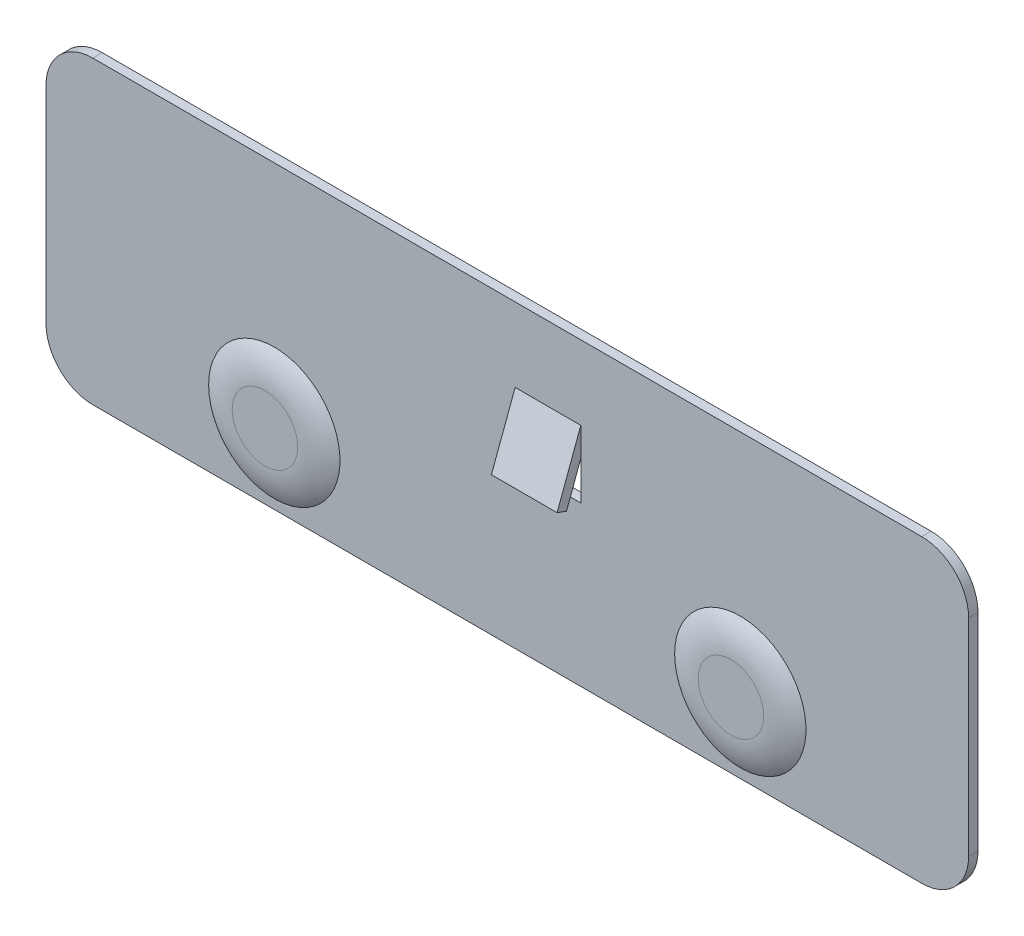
ISO-10303-21;
HEADER;
FILE_DESCRIPTION(('STEP AP214'),'2;1');
FILE_NAME('part.step','',(''),(''),'','','');
FILE_SCHEMA(('AUTOMOTIVE_DESIGN { 1 0 10303 214 1 1 1 1 }'));
ENDSEC;
DATA;
#1=APPLICATION_CONTEXT('core data for automotive mechanical design processes');
#2=APPLICATION_PROTOCOL_DEFINITION('international standard','automotive_design',2000,#1);
#3=PRODUCT_CONTEXT('',#1,'mechanical');
#4=PRODUCT('Part','Part','',(#3));
#5=PRODUCT_RELATED_PRODUCT_CATEGORY('part','',(#4));
#6=PRODUCT_DEFINITION_FORMATION('','',#4);
#7=PRODUCT_DEFINITION_CONTEXT('part definition',#1,'design');
#8=PRODUCT_DEFINITION('design','',#6,#7);
#9=PRODUCT_DEFINITION_SHAPE('','',#8);
#10=(LENGTH_UNIT() NAMED_UNIT(*) SI_UNIT(.MILLI.,.METRE.));
#11=(NAMED_UNIT(*) PLANE_ANGLE_UNIT() SI_UNIT($,.RADIAN.));
#12=(NAMED_UNIT(*) SI_UNIT($,.STERADIAN.) SOLID_ANGLE_UNIT());
#13=UNCERTAINTY_MEASURE_WITH_UNIT(LENGTH_MEASURE(1.E-05),#10,'distance_accuracy_value','');
#14=(GEOMETRIC_REPRESENTATION_CONTEXT(3) GLOBAL_UNCERTAINTY_ASSIGNED_CONTEXT((#13)) GLOBAL_UNIT_ASSIGNED_CONTEXT((#10,
#11,#12)) REPRESENTATION_CONTEXT('',''));
#15=CARTESIAN_POINT('',(0.,0.,0.));
#16=DIRECTION('',(0.,0.,1.));
#17=DIRECTION('',(1.,0.,0.));
#18=AXIS2_PLACEMENT_3D('',#15,#16,#17);
#19=CARTESIAN_POINT('',(1.5,8.1,0.));
#20=DIRECTION('',(0.,0.,-1.));
#21=DIRECTION('',(-1.,0.,0.));
#22=AXIS2_PLACEMENT_3D('',#19,#20,#21);
#23=PLANE('',#22);
#24=CARTESIAN_POINT('',(22.2,2.4,0.));
#25=DIRECTION('',(0.,0.,-1.));
#26=DIRECTION('',(-1.,0.,0.));
#27=AXIS2_PLACEMENT_3D('',#24,#25,#26);
#28=CIRCLE('',#27,1.70825756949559);
#29=CARTESIAN_POINT('',(20.4917424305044,2.4,0.));
#30=VERTEX_POINT('',#29);
#31=EDGE_CURVE('E251',#30,#30,#28,.F.);
#32=ORIENTED_EDGE('',*,*,#31,.T.);
#33=EDGE_LOOP('',(#32));
#34=FACE_BOUND('',#33,.T.);
#35=CARTESIAN_POINT('',(7.3,2.4,0.));
#36=DIRECTION('',(0.,0.,-1.));
#37=DIRECTION('',(-1.,0.,0.));
#38=AXIS2_PLACEMENT_3D('',#35,#36,#37);
#39=CIRCLE('',#38,1.70825756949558);
#40=CARTESIAN_POINT('',(5.59174243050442,2.4,0.));
#41=VERTEX_POINT('',#40);
#42=EDGE_CURVE('E248',#41,#41,#39,.F.);
#43=ORIENTED_EDGE('',*,*,#42,.T.);
#44=EDGE_LOOP('',(#43));
#45=FACE_BOUND('',#44,.T.);
#46=CARTESIAN_POINT('',(1.5,8.1,0.));
#47=DIRECTION('',(0.,0.,1.));
#48=DIRECTION('',(-1.,0.,0.));
#49=AXIS2_PLACEMENT_3D('',#46,#47,#48);
#50=CIRCLE('',#49,1.5);
#51=CARTESIAN_POINT('',(1.5,9.6,0.));
#52=VERTEX_POINT('',#51);
#53=CARTESIAN_POINT('',(0.,8.1,0.));
#54=VERTEX_POINT('',#53);
#55=EDGE_CURVE('E178',#52,#54,#50,.T.);
#56=ORIENTED_EDGE('',*,*,#55,.F.);
#57=DIRECTION('',(-1.,0.,0.));
#58=VECTOR('',#57,1.);
#59=CARTESIAN_POINT('',(1.5,9.6,0.));
#60=LINE('',#59,#58);
#61=CARTESIAN_POINT('',(28.,9.6,0.));
#62=VERTEX_POINT('',#61);
#63=EDGE_CURVE('E201',#62,#52,#60,.T.);
#64=ORIENTED_EDGE('',*,*,#63,.F.);
#65=CARTESIAN_POINT('',(28.,8.1,0.));
#66=DIRECTION('',(0.,0.,1.));
#67=DIRECTION('',(-1.,0.,0.));
#68=AXIS2_PLACEMENT_3D('',#65,#66,#67);
#69=CIRCLE('',#68,1.5);
#70=CARTESIAN_POINT('',(29.5,8.1,0.));
#71=VERTEX_POINT('',#70);
#72=EDGE_CURVE('E199',#71,#62,#69,.T.);
#73=ORIENTED_EDGE('',*,*,#72,.F.);
#74=DIRECTION('',(0.,1.,0.));
#75=VECTOR('',#74,1.);
#76=CARTESIAN_POINT('',(29.5,1.5,0.));
#77=LINE('',#76,#75);
#78=CARTESIAN_POINT('',(29.5,1.5,0.));
#79=VERTEX_POINT('',#78);
#80=EDGE_CURVE('E197',#79,#71,#77,.T.);
#81=ORIENTED_EDGE('',*,*,#80,.F.);
#82=CARTESIAN_POINT('',(28.,1.5,0.));
#83=DIRECTION('',(0.,0.,1.));
#84=DIRECTION('',(1.,0.,0.));
#85=AXIS2_PLACEMENT_3D('',#82,#83,#84);
#86=CIRCLE('',#85,1.5);
#87=CARTESIAN_POINT('',(28.,0.,0.));
#88=VERTEX_POINT('',#87);
#89=EDGE_CURVE('E195',#88,#79,#86,.T.);
#90=ORIENTED_EDGE('',*,*,#89,.F.);
#91=DIRECTION('',(1.,0.,0.));
#92=VECTOR('',#91,1.);
#93=CARTESIAN_POINT('',(1.50000000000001,0.,0.));
#94=LINE('',#93,#92);
#95=CARTESIAN_POINT('',(1.50000000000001,0.,0.));
#96=VERTEX_POINT('',#95);
#97=EDGE_CURVE('E193',#96,#88,#94,.T.);
#98=ORIENTED_EDGE('',*,*,#97,.F.);
#99=CARTESIAN_POINT('',(1.5,1.5,0.));
#100=DIRECTION('',(0.,0.,1.));
#101=DIRECTION('',(-1.,0.,0.));
#102=AXIS2_PLACEMENT_3D('',#99,#100,#101);
#103=CIRCLE('',#102,1.5);
#104=CARTESIAN_POINT('',(0.,1.50000000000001,0.));
#105=VERTEX_POINT('',#104);
#106=EDGE_CURVE('E191',#105,#96,#103,.T.);
#107=ORIENTED_EDGE('',*,*,#106,.F.);
#108=DIRECTION('',(0.,-1.,0.));
#109=VECTOR('',#108,1.);
#110=CARTESIAN_POINT('',(0.,1.50000000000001,0.));
#111=LINE('',#110,#109);
#112=EDGE_CURVE('E189',#54,#105,#111,.T.);
#113=ORIENTED_EDGE('',*,*,#112,.F.);
#114=EDGE_LOOP('',(#56,#64,#73,#81,#90,#98,#107,#113));
#115=FACE_BOUND('',#114,.T.);
#116=DIRECTION('',(-1.,0.,0.));
#117=VECTOR('',#116,1.);
#118=CARTESIAN_POINT('',(17.1,5.081395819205,0.));
#119=LINE('',#118,#117);
#120=CARTESIAN_POINT('',(17.1,5.081395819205,0.));
#121=VERTEX_POINT('',#120);
#122=CARTESIAN_POINT('',(15.,5.081395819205,0.));
#123=VERTEX_POINT('',#122);
#124=EDGE_CURVE('E284',#121,#123,#119,.T.);
#125=ORIENTED_EDGE('',*,*,#124,.F.);
#126=DIRECTION('',(0.,-1.,0.));
#127=VECTOR('',#126,1.);
#128=CARTESIAN_POINT('',(17.1,7.11976791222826,0.));
#129=LINE('',#128,#127);
#130=CARTESIAN_POINT('',(17.1,7.11976791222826,0.));
#131=VERTEX_POINT('',#130);
#132=EDGE_CURVE('E270',#131,#121,#129,.T.);
#133=ORIENTED_EDGE('',*,*,#132,.F.);
#134=DIRECTION('',(-1.,0.,0.));
#135=VECTOR('',#134,1.);
#136=CARTESIAN_POINT('',(17.1,7.11976791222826,0.));
#137=LINE('',#136,#135);
#138=CARTESIAN_POINT('',(15.,7.11976791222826,0.));
#139=VERTEX_POINT('',#138);
#140=EDGE_CURVE('E271',#131,#139,#137,.T.);
#141=ORIENTED_EDGE('',*,*,#140,.T.);
#142=DIRECTION('',(0.,-1.,0.));
#143=VECTOR('',#142,1.);
#144=CARTESIAN_POINT('',(15.,7.11976791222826,0.));
#145=LINE('',#144,#143);
#146=EDGE_CURVE('E288',#139,#123,#145,.T.);
#147=ORIENTED_EDGE('',*,*,#146,.T.);
#148=EDGE_LOOP('',(#125,#133,#141,#147));
#149=FACE_BOUND('',#148,.T.);
#150=ADVANCED_FACE('F31',(#34,#45,#115,#149),#23,.T.);
#151=CARTESIAN_POINT('',(1.5,8.1,0.3));
#152=DIRECTION('',(0.,0.,-1.));
#153=DIRECTION('',(-1.,0.,0.));
#154=AXIS2_PLACEMENT_3D('',#151,#152,#153);
#155=PLANE('',#154);
#156=CARTESIAN_POINT('',(22.2,2.4,0.3));
#157=DIRECTION('',(0.,0.,-1.));
#158=DIRECTION('',(-1.,0.,0.));
#159=AXIS2_PLACEMENT_3D('',#156,#157,#158);
#160=CIRCLE('',#159,2.1);
#161=CARTESIAN_POINT('',(20.1,2.4,0.3));
#162=VERTEX_POINT('',#161);
#163=EDGE_CURVE('E179',#162,#162,#160,.F.);
#164=ORIENTED_EDGE('',*,*,#163,.F.);
#165=EDGE_LOOP('',(#164));
#166=FACE_BOUND('',#165,.T.);
#167=CARTESIAN_POINT('',(1.5,8.1,0.3));
#168=DIRECTION('',(0.,0.,1.));
#169=DIRECTION('',(-1.,0.,0.));
#170=AXIS2_PLACEMENT_3D('',#167,#168,#169);
#171=CIRCLE('',#170,1.5);
#172=CARTESIAN_POINT('',(1.5,9.6,0.3));
#173=VERTEX_POINT('',#172);
#174=CARTESIAN_POINT('',(0.,8.1,0.3));
#175=VERTEX_POINT('',#174);
#176=EDGE_CURVE('E203',#173,#175,#171,.T.);
#177=ORIENTED_EDGE('',*,*,#176,.T.);
#178=DIRECTION('',(0.,-1.,0.));
#179=VECTOR('',#178,1.);
#180=CARTESIAN_POINT('',(0.,1.50000000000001,0.3));
#181=LINE('',#180,#179);
#182=CARTESIAN_POINT('',(0.,1.50000000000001,0.3));
#183=VERTEX_POINT('',#182);
#184=EDGE_CURVE('E206',#175,#183,#181,.T.);
#185=ORIENTED_EDGE('',*,*,#184,.T.);
#186=CARTESIAN_POINT('',(1.5,1.5,0.3));
#187=DIRECTION('',(0.,0.,1.));
#188=DIRECTION('',(-1.,0.,0.));
#189=AXIS2_PLACEMENT_3D('',#186,#187,#188);
#190=CIRCLE('',#189,1.5);
#191=CARTESIAN_POINT('',(1.50000000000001,0.,0.3));
#192=VERTEX_POINT('',#191);
#193=EDGE_CURVE('E208',#183,#192,#190,.T.);
#194=ORIENTED_EDGE('',*,*,#193,.T.);
#195=DIRECTION('',(1.,0.,0.));
#196=VECTOR('',#195,1.);
#197=CARTESIAN_POINT('',(1.50000000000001,0.,0.3));
#198=LINE('',#197,#196);
#199=CARTESIAN_POINT('',(28.,0.,0.3));
#200=VERTEX_POINT('',#199);
#201=EDGE_CURVE('E210',#192,#200,#198,.T.);
#202=ORIENTED_EDGE('',*,*,#201,.T.);
#203=CARTESIAN_POINT('',(28.,1.5,0.3));
#204=DIRECTION('',(0.,0.,1.));
#205=DIRECTION('',(1.,0.,0.));
#206=AXIS2_PLACEMENT_3D('',#203,#204,#205);
#207=CIRCLE('',#206,1.5);
#208=CARTESIAN_POINT('',(29.5,1.5,0.3));
#209=VERTEX_POINT('',#208);
#210=EDGE_CURVE('E212',#200,#209,#207,.T.);
#211=ORIENTED_EDGE('',*,*,#210,.T.);
#212=DIRECTION('',(0.,1.,0.));
#213=VECTOR('',#212,1.);
#214=CARTESIAN_POINT('',(29.5,1.5,0.3));
#215=LINE('',#214,#213);
#216=CARTESIAN_POINT('',(29.5,8.1,0.3));
#217=VERTEX_POINT('',#216);
#218=EDGE_CURVE('E214',#209,#217,#215,.T.);
#219=ORIENTED_EDGE('',*,*,#218,.T.);
#220=CARTESIAN_POINT('',(28.,8.1,0.3));
#221=DIRECTION('',(0.,0.,1.));
#222=DIRECTION('',(-1.,0.,0.));
#223=AXIS2_PLACEMENT_3D('',#220,#221,#222);
#224=CIRCLE('',#223,1.5);
#225=CARTESIAN_POINT('',(28.,9.6,0.3));
#226=VERTEX_POINT('',#225);
#227=EDGE_CURVE('E216',#217,#226,#224,.T.);
#228=ORIENTED_EDGE('',*,*,#227,.T.);
#229=DIRECTION('',(-1.,0.,0.));
#230=VECTOR('',#229,1.);
#231=CARTESIAN_POINT('',(1.5,9.6,0.3));
#232=LINE('',#231,#230);
#233=EDGE_CURVE('E218',#226,#173,#232,.T.);
#234=ORIENTED_EDGE('',*,*,#233,.T.);
#235=EDGE_LOOP('',(#177,#185,#194,#202,#211,#219,#228,#234));
#236=FACE_BOUND('',#235,.T.);
#237=CARTESIAN_POINT('',(7.3,2.4,0.3));
#238=DIRECTION('',(0.,0.,-1.));
#239=DIRECTION('',(-1.,0.,0.));
#240=AXIS2_PLACEMENT_3D('',#237,#238,#239);
#241=CIRCLE('',#240,2.1);
#242=CARTESIAN_POINT('',(5.2,2.4,0.3));
#243=VERTEX_POINT('',#242);
#244=EDGE_CURVE('E183',#243,#243,#241,.F.);
#245=ORIENTED_EDGE('',*,*,#244,.F.);
#246=EDGE_LOOP('',(#245));
#247=FACE_BOUND('',#246,.T.);
#248=DIRECTION('',(0.,-1.,0.));
#249=VECTOR('',#248,1.);
#250=CARTESIAN_POINT('',(15.,8.1,0.3));
#251=LINE('',#250,#249);
#252=CARTESIAN_POINT('',(15.,7.231395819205,0.3));
#253=VERTEX_POINT('',#252);
#254=CARTESIAN_POINT('',(15.,6.31351791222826,0.3));
#255=VERTEX_POINT('',#254);
#256=EDGE_CURVE('E11',#253,#255,#251,.T.);
#257=ORIENTED_EDGE('',*,*,#256,.F.);
#258=DIRECTION('',(-1.,0.,0.));
#259=VECTOR('',#258,1.);
#260=CARTESIAN_POINT('',(1.5,7.231395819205,0.3));
#261=LINE('',#260,#259);
#262=CARTESIAN_POINT('',(17.1,7.231395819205,0.3));
#263=VERTEX_POINT('',#262);
#264=EDGE_CURVE('E162',#263,#253,#261,.T.);
#265=ORIENTED_EDGE('',*,*,#264,.F.);
#266=DIRECTION('',(0.,1.,0.));
#267=VECTOR('',#266,1.);
#268=CARTESIAN_POINT('',(17.1,8.1,0.3));
#269=LINE('',#268,#267);
#270=CARTESIAN_POINT('',(17.1,6.31351791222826,0.3));
#271=VERTEX_POINT('',#270);
#272=EDGE_CURVE('E255',#271,#263,#269,.T.);
#273=ORIENTED_EDGE('',*,*,#272,.F.);
#274=CARTESIAN_POINT('',(17.1,5.081395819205,0.3));
#275=VERTEX_POINT('',#274);
#276=EDGE_CURVE('E256',#275,#271,#269,.T.);
#277=ORIENTED_EDGE('',*,*,#276,.F.);
#278=DIRECTION('',(1.,0.,0.));
#279=VECTOR('',#278,1.);
#280=CARTESIAN_POINT('',(1.5,5.081395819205,0.3));
#281=LINE('',#280,#279);
#282=CARTESIAN_POINT('',(15.,5.081395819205,0.3));
#283=VERTEX_POINT('',#282);
#284=EDGE_CURVE('E39',#283,#275,#281,.T.);
#285=ORIENTED_EDGE('',*,*,#284,.F.);
#286=DIRECTION('',(0.,1.,0.));
#287=VECTOR('',#286,1.);
#288=CARTESIAN_POINT('',(15.,8.1,0.3));
#289=LINE('',#288,#287);
#290=EDGE_CURVE('E164',#283,#255,#289,.T.);
#291=ORIENTED_EDGE('',*,*,#290,.T.);
#292=EDGE_LOOP('',(#257,#265,#273,#277,#285,#291));
#293=FACE_BOUND('',#292,.T.);
#294=ADVANCED_FACE('F274',(#166,#236,#247,#293),#155,.F.);
#295=CARTESIAN_POINT('',(1.5,8.1,0.3));
#296=DIRECTION('',(0.,0.,-1.));
#297=DIRECTION('',(-1.,0.,0.));
#298=AXIS2_PLACEMENT_3D('',#295,#296,#297);
#299=CYLINDRICAL_SURFACE('',#298,1.5);
#300=ORIENTED_EDGE('',*,*,#55,.T.);
#301=DIRECTION('',(0.,0.,-1.));
#302=VECTOR('',#301,1.);
#303=CARTESIAN_POINT('',(0.,8.1,0.3));
#304=LINE('',#303,#302);
#305=EDGE_CURVE('E186',#175,#54,#304,.T.);
#306=ORIENTED_EDGE('',*,*,#305,.F.);
#307=ORIENTED_EDGE('',*,*,#176,.F.);
#308=DIRECTION('',(0.,0.,-1.));
#309=VECTOR('',#308,1.);
#310=CARTESIAN_POINT('',(1.5,9.6,0.3));
#311=LINE('',#310,#309);
#312=EDGE_CURVE('E220',#173,#52,#311,.T.);
#313=ORIENTED_EDGE('',*,*,#312,.T.);
#314=EDGE_LOOP('',(#300,#306,#307,#313));
#315=FACE_BOUND('',#314,.T.);
#316=ADVANCED_FACE('F33',(#315),#299,.T.);
#317=CARTESIAN_POINT('',(0.,1.50000000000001,0.3));
#318=DIRECTION('',(1.,0.,0.));
#319=DIRECTION('',(0.,0.,-1.));
#320=AXIS2_PLACEMENT_3D('',#317,#318,#319);
#321=PLANE('',#320);
#322=ORIENTED_EDGE('',*,*,#112,.T.);
#323=DIRECTION('',(0.,0.,-1.));
#324=VECTOR('',#323,1.);
#325=CARTESIAN_POINT('',(0.,1.50000000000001,0.3));
#326=LINE('',#325,#324);
#327=EDGE_CURVE('E238',#183,#105,#326,.T.);
#328=ORIENTED_EDGE('',*,*,#327,.F.);
#329=ORIENTED_EDGE('',*,*,#184,.F.);
#330=ORIENTED_EDGE('',*,*,#305,.T.);
#331=EDGE_LOOP('',(#322,#328,#329,#330));
#332=FACE_BOUND('',#331,.T.);
#333=ADVANCED_FACE('F338',(#332),#321,.F.);
#334=CARTESIAN_POINT('',(1.5,1.5,0.3));
#335=DIRECTION('',(0.,0.,-1.));
#336=DIRECTION('',(-1.,0.,0.));
#337=AXIS2_PLACEMENT_3D('',#334,#335,#336);
#338=CYLINDRICAL_SURFACE('',#337,1.5);
#339=ORIENTED_EDGE('',*,*,#106,.T.);
#340=DIRECTION('',(0.,0.,-1.));
#341=VECTOR('',#340,1.);
#342=CARTESIAN_POINT('',(1.50000000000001,0.,0.3));
#343=LINE('',#342,#341);
#344=EDGE_CURVE('E235',#192,#96,#343,.T.);
#345=ORIENTED_EDGE('',*,*,#344,.F.);
#346=ORIENTED_EDGE('',*,*,#193,.F.);
#347=ORIENTED_EDGE('',*,*,#327,.T.);
#348=EDGE_LOOP('',(#339,#345,#346,#347));
#349=FACE_BOUND('',#348,.T.);
#350=ADVANCED_FACE('F335',(#349),#338,.T.);
#351=CARTESIAN_POINT('',(1.50000000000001,0.,0.3));
#352=DIRECTION('',(0.,1.,0.));
#353=DIRECTION('',(0.,0.,1.));
#354=AXIS2_PLACEMENT_3D('',#351,#352,#353);
#355=PLANE('',#354);
#356=ORIENTED_EDGE('',*,*,#97,.T.);
#357=DIRECTION('',(0.,0.,-1.));
#358=VECTOR('',#357,1.);
#359=CARTESIAN_POINT('',(28.,0.,0.3));
#360=LINE('',#359,#358);
#361=EDGE_CURVE('E232',#200,#88,#360,.T.);
#362=ORIENTED_EDGE('',*,*,#361,.F.);
#363=ORIENTED_EDGE('',*,*,#201,.F.);
#364=ORIENTED_EDGE('',*,*,#344,.T.);
#365=EDGE_LOOP('',(#356,#362,#363,#364));
#366=FACE_BOUND('',#365,.T.);
#367=ADVANCED_FACE('F331',(#366),#355,.F.);
#368=CARTESIAN_POINT('',(28.,1.5,0.3));
#369=DIRECTION('',(0.,0.,-1.));
#370=DIRECTION('',(-1.,0.,0.));
#371=AXIS2_PLACEMENT_3D('',#368,#369,#370);
#372=CYLINDRICAL_SURFACE('',#371,1.5);
#373=ORIENTED_EDGE('',*,*,#89,.T.);
#374=DIRECTION('',(0.,0.,-1.));
#375=VECTOR('',#374,1.);
#376=CARTESIAN_POINT('',(29.5,1.5,0.3));
#377=LINE('',#376,#375);
#378=EDGE_CURVE('E229',#209,#79,#377,.T.);
#379=ORIENTED_EDGE('',*,*,#378,.F.);
#380=ORIENTED_EDGE('',*,*,#210,.F.);
#381=ORIENTED_EDGE('',*,*,#361,.T.);
#382=EDGE_LOOP('',(#373,#379,#380,#381));
#383=FACE_BOUND('',#382,.T.);
#384=ADVANCED_FACE('F327',(#383),#372,.T.);
#385=CARTESIAN_POINT('',(29.5,1.5,0.3));
#386=DIRECTION('',(-1.,0.,0.));
#387=DIRECTION('',(0.,0.,1.));
#388=AXIS2_PLACEMENT_3D('',#385,#386,#387);
#389=PLANE('',#388);
#390=ORIENTED_EDGE('',*,*,#80,.T.);
#391=DIRECTION('',(0.,0.,-1.));
#392=VECTOR('',#391,1.);
#393=CARTESIAN_POINT('',(29.5,8.1,0.3));
#394=LINE('',#393,#392);
#395=EDGE_CURVE('E226',#217,#71,#394,.T.);
#396=ORIENTED_EDGE('',*,*,#395,.F.);
#397=ORIENTED_EDGE('',*,*,#218,.F.);
#398=ORIENTED_EDGE('',*,*,#378,.T.);
#399=EDGE_LOOP('',(#390,#396,#397,#398));
#400=FACE_BOUND('',#399,.T.);
#401=ADVANCED_FACE('F323',(#400),#389,.F.);
#402=CARTESIAN_POINT('',(28.,8.1,0.3));
#403=DIRECTION('',(0.,0.,-1.));
#404=DIRECTION('',(-1.,0.,0.));
#405=AXIS2_PLACEMENT_3D('',#402,#403,#404);
#406=CYLINDRICAL_SURFACE('',#405,1.5);
#407=ORIENTED_EDGE('',*,*,#72,.T.);
#408=DIRECTION('',(0.,0.,-1.));
#409=VECTOR('',#408,1.);
#410=CARTESIAN_POINT('',(28.,9.6,0.3));
#411=LINE('',#410,#409);
#412=EDGE_CURVE('E223',#226,#62,#411,.T.);
#413=ORIENTED_EDGE('',*,*,#412,.F.);
#414=ORIENTED_EDGE('',*,*,#227,.F.);
#415=ORIENTED_EDGE('',*,*,#395,.T.);
#416=EDGE_LOOP('',(#407,#413,#414,#415));
#417=FACE_BOUND('',#416,.T.);
#418=ADVANCED_FACE('F319',(#417),#406,.T.);
#419=CARTESIAN_POINT('',(1.5,9.6,0.3));
#420=DIRECTION('',(0.,-1.,0.));
#421=DIRECTION('',(0.,0.,-1.));
#422=AXIS2_PLACEMENT_3D('',#419,#420,#421);
#423=PLANE('',#422);
#424=ORIENTED_EDGE('',*,*,#63,.T.);
#425=ORIENTED_EDGE('',*,*,#312,.F.);
#426=ORIENTED_EDGE('',*,*,#233,.F.);
#427=ORIENTED_EDGE('',*,*,#412,.T.);
#428=EDGE_LOOP('',(#424,#425,#426,#427));
#429=FACE_BOUND('',#428,.T.);
#430=ADVANCED_FACE('F316',(#429),#423,.F.);
#431=CARTESIAN_POINT('',(7.3,2.4,0.6));
#432=DIRECTION('',(0.,0.,1.));
#433=DIRECTION('',(1.,0.,0.));
#434=AXIS2_PLACEMENT_3D('',#431,#432,#433);
#435=PLANE('',#434);
#436=CARTESIAN_POINT('',(7.3,2.4,0.6));
#437=DIRECTION('',(0.,0.,1.));
#438=DIRECTION('',(1.,0.,0.));
#439=AXIS2_PLACEMENT_3D('',#436,#437,#438);
#440=CIRCLE('',#439,1.04643462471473);
#441=CARTESIAN_POINT('',(8.34643462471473,2.4,0.6));
#442=VERTEX_POINT('',#441);
#443=EDGE_CURVE('E245',#442,#442,#440,.T.);
#444=ORIENTED_EDGE('',*,*,#443,.T.);
#445=EDGE_LOOP('',(#444));
#446=FACE_BOUND('',#445,.T.);
#447=ADVANCED_FACE('F313',(#446),#435,.T.);
#448=CARTESIAN_POINT('',(22.2,2.4,0.6));
#449=DIRECTION('',(0.,0.,1.));
#450=DIRECTION('',(1.,0.,0.));
#451=AXIS2_PLACEMENT_3D('',#448,#449,#450);
#452=PLANE('',#451);
#453=CARTESIAN_POINT('',(22.2,2.4,0.6));
#454=DIRECTION('',(0.,0.,1.));
#455=DIRECTION('',(1.,0.,0.));
#456=AXIS2_PLACEMENT_3D('',#453,#454,#455);
#457=CIRCLE('',#456,1.04643462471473);
#458=CARTESIAN_POINT('',(23.2464346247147,2.4,0.6));
#459=VERTEX_POINT('',#458);
#460=EDGE_CURVE('E182',#459,#459,#457,.T.);
#461=ORIENTED_EDGE('',*,*,#460,.T.);
#462=EDGE_LOOP('',(#461));
#463=FACE_BOUND('',#462,.T.);
#464=ADVANCED_FACE('F382',(#463),#452,.T.);
#465=CARTESIAN_POINT('',(22.2,2.4,-1.4));
#466=DIRECTION('',(0.,0.,-1.));
#467=DIRECTION('',(-1.,0.,0.));
#468=AXIS2_PLACEMENT_3D('',#465,#466,#467);
#469=DEGENERATE_TOROIDAL_SURFACE('',#468,1.04643462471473,2.,.T.);
#470=ORIENTED_EDGE('',*,*,#163,.T.);
#471=EDGE_LOOP('',(#470));
#472=FACE_BOUND('',#471,.T.);
#473=ORIENTED_EDGE('',*,*,#460,.F.);
#474=EDGE_LOOP('',(#473));
#475=FACE_BOUND('',#474,.T.);
#476=ADVANCED_FACE('F377',(#472,#475),#469,.T.);
#477=CARTESIAN_POINT('',(7.3,2.4,-1.4));
#478=DIRECTION('',(0.,0.,-1.));
#479=DIRECTION('',(-1.,0.,0.));
#480=AXIS2_PLACEMENT_3D('',#477,#478,#479);
#481=DEGENERATE_TOROIDAL_SURFACE('',#480,1.04643462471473,2.,.T.);
#482=ORIENTED_EDGE('',*,*,#244,.T.);
#483=EDGE_LOOP('',(#482));
#484=FACE_BOUND('',#483,.T.);
#485=ORIENTED_EDGE('',*,*,#443,.F.);
#486=EDGE_LOOP('',(#485));
#487=FACE_BOUND('',#486,.T.);
#488=ADVANCED_FACE('F373',(#484,#487),#481,.T.);
#489=CARTESIAN_POINT('',(7.3,2.4,0.3));
#490=DIRECTION('',(0.,0.,1.));
#491=DIRECTION('',(1.,0.,0.));
#492=AXIS2_PLACEMENT_3D('',#489,#490,#491);
#493=PLANE('',#492);
#494=CARTESIAN_POINT('',(7.3,2.4,0.3));
#495=DIRECTION('',(0.,0.,1.));
#496=DIRECTION('',(1.,0.,0.));
#497=AXIS2_PLACEMENT_3D('',#494,#495,#496);
#498=CIRCLE('',#497,1.25);
#499=CARTESIAN_POINT('',(8.55,2.4,0.3));
#500=VERTEX_POINT('',#499);
#501=EDGE_CURVE('E175',#500,#500,#498,.T.);
#502=ORIENTED_EDGE('',*,*,#501,.F.);
#503=EDGE_LOOP('',(#502));
#504=FACE_BOUND('',#503,.T.);
#505=ADVANCED_FACE('F376',(#504),#493,.F.);
#506=CARTESIAN_POINT('',(22.2,2.4,0.3));
#507=DIRECTION('',(0.,0.,1.));
#508=DIRECTION('',(1.,0.,0.));
#509=AXIS2_PLACEMENT_3D('',#506,#507,#508);
#510=PLANE('',#509);
#511=CARTESIAN_POINT('',(22.2,2.4,0.3));
#512=DIRECTION('',(0.,0.,1.));
#513=DIRECTION('',(1.,0.,0.));
#514=AXIS2_PLACEMENT_3D('',#511,#512,#513);
#515=CIRCLE('',#514,1.25);
#516=CARTESIAN_POINT('',(23.45,2.4,0.3));
#517=VERTEX_POINT('',#516);
#518=EDGE_CURVE('E166',#517,#517,#515,.T.);
#519=ORIENTED_EDGE('',*,*,#518,.F.);
#520=EDGE_LOOP('',(#519));
#521=FACE_BOUND('',#520,.T.);
#522=ADVANCED_FACE('F395',(#521),#510,.F.);
#523=CARTESIAN_POINT('',(22.2,2.4,0.5));
#524=DIRECTION('',(0.,0.,-1.));
#525=DIRECTION('',(-1.,0.,0.));
#526=AXIS2_PLACEMENT_3D('',#523,#524,#525);
#527=TOROIDAL_SURFACE('',#526,1.70825756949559,0.5);
#528=ORIENTED_EDGE('',*,*,#518,.T.);
#529=EDGE_LOOP('',(#528));
#530=FACE_BOUND('',#529,.T.);
#531=ORIENTED_EDGE('',*,*,#31,.F.);
#532=EDGE_LOOP('',(#531));
#533=FACE_BOUND('',#532,.T.);
#534=ADVANCED_FACE('F399',(#530,#533),#527,.T.);
#535=CARTESIAN_POINT('',(7.3,2.4,0.5));
#536=DIRECTION('',(0.,0.,-1.));
#537=DIRECTION('',(-1.,0.,0.));
#538=AXIS2_PLACEMENT_3D('',#535,#536,#537);
#539=TOROIDAL_SURFACE('',#538,1.70825756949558,0.5);
#540=ORIENTED_EDGE('',*,*,#501,.T.);
#541=EDGE_LOOP('',(#540));
#542=FACE_BOUND('',#541,.T.);
#543=ORIENTED_EDGE('',*,*,#42,.F.);
#544=EDGE_LOOP('',(#543));
#545=FACE_BOUND('',#544,.T.);
#546=ADVANCED_FACE('F403',(#542,#545),#539,.T.);
#547=CARTESIAN_POINT('',(15.,7.231395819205,1.1));
#548=DIRECTION('',(1.,0.,0.));
#549=DIRECTION('',(0.,0.,-1.));
#550=AXIS2_PLACEMENT_3D('',#547,#548,#549);
#551=PLANE('',#550);
#552=DIRECTION('',(0.,0.937221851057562,-0.348733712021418));
#553=VECTOR('',#552,1.);
#554=CARTESIAN_POINT('',(15.,7.11976791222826,0.));
#555=LINE('',#554,#553);
#556=CARTESIAN_POINT('',(15.,5.081395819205,0.758464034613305));
#557=VERTEX_POINT('',#556);
#558=EDGE_CURVE('E158',#557,#255,#555,.T.);
#559=ORIENTED_EDGE('',*,*,#558,.F.);
#560=DIRECTION('',(0.,-0.348733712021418,-0.937221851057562));
#561=VECTOR('',#560,1.);
#562=CARTESIAN_POINT('',(15.,5.081395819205,0.758464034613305));
#563=LINE('',#562,#561);
#564=CARTESIAN_POINT('',(15.,5.19302372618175,1.0584640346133));
#565=VERTEX_POINT('',#564);
#566=EDGE_CURVE('E142',#565,#557,#563,.T.);
#567=ORIENTED_EDGE('',*,*,#566,.F.);
#568=DIRECTION('',(0.,-0.937221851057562,0.348733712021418));
#569=VECTOR('',#568,1.);
#570=CARTESIAN_POINT('',(15.,7.231395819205,0.3));
#571=LINE('',#570,#569);
#572=EDGE_CURVE('E155',#253,#565,#571,.T.);
#573=ORIENTED_EDGE('',*,*,#572,.F.);
#574=ORIENTED_EDGE('',*,*,#256,.T.);
#575=EDGE_LOOP('',(#559,#567,#573,#574));
#576=FACE_BOUND('',#575,.T.);
#577=ADVANCED_FACE('F154',(#576),#551,.F.);
#578=CARTESIAN_POINT('',(17.1,7.231395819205,1.1));
#579=DIRECTION('',(-1.,0.,0.));
#580=DIRECTION('',(0.,0.,1.));
#581=AXIS2_PLACEMENT_3D('',#578,#579,#580);
#582=PLANE('',#581);
#583=DIRECTION('',(0.,-0.937221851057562,0.348733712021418));
#584=VECTOR('',#583,1.);
#585=CARTESIAN_POINT('',(17.1,7.231395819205,0.3));
#586=LINE('',#585,#584);
#587=CARTESIAN_POINT('',(17.1,5.19302372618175,1.0584640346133));
#588=VERTEX_POINT('',#587);
#589=EDGE_CURVE('E163',#263,#588,#586,.T.);
#590=ORIENTED_EDGE('',*,*,#589,.T.);
#591=DIRECTION('',(0.,-0.348733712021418,-0.937221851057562));
#592=VECTOR('',#591,1.);
#593=CARTESIAN_POINT('',(17.1,5.45449641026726,1.76117187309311));
#594=LINE('',#593,#592);
#595=CARTESIAN_POINT('',(17.1,5.081395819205,0.758464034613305));
#596=VERTEX_POINT('',#595);
#597=EDGE_CURVE('E145',#588,#596,#594,.T.);
#598=ORIENTED_EDGE('',*,*,#597,.T.);
#599=DIRECTION('',(0.,0.937221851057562,-0.348733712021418));
#600=VECTOR('',#599,1.);
#601=CARTESIAN_POINT('',(17.1,7.11976791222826,0.));
#602=LINE('',#601,#600);
#603=EDGE_CURVE('E277',#596,#271,#602,.T.);
#604=ORIENTED_EDGE('',*,*,#603,.T.);
#605=ORIENTED_EDGE('',*,*,#272,.T.);
#606=EDGE_LOOP('',(#590,#598,#604,#605));
#607=FACE_BOUND('',#606,.T.);
#608=ADVANCED_FACE('F276',(#607),#582,.F.);
#609=CARTESIAN_POINT('',(17.1,7.231395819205,0.3));
#610=DIRECTION('',(0.,-0.348733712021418,-0.937221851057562));
#611=DIRECTION('',(0.,0.937221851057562,-0.348733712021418));
#612=AXIS2_PLACEMENT_3D('',#609,#610,#611);
#613=PLANE('',#612);
#614=ORIENTED_EDGE('',*,*,#572,.T.);
#615=DIRECTION('',(-1.,0.,0.));
#616=VECTOR('',#615,1.);
#617=CARTESIAN_POINT('',(29.5,5.19302372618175,1.0584640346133));
#618=LINE('',#617,#616);
#619=EDGE_CURVE('E139',#588,#565,#618,.T.);
#620=ORIENTED_EDGE('',*,*,#619,.F.);
#621=ORIENTED_EDGE('',*,*,#589,.F.);
#622=ORIENTED_EDGE('',*,*,#264,.T.);
#623=EDGE_LOOP('',(#614,#620,#621,#622));
#624=FACE_BOUND('',#623,.T.);
#625=ADVANCED_FACE('F160',(#624),#613,.F.);
#626=CARTESIAN_POINT('',(17.1,5.081395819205,0.758464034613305));
#627=DIRECTION('',(-1.,0.,0.));
#628=DIRECTION('',(0.,0.,1.));
#629=AXIS2_PLACEMENT_3D('',#626,#627,#628);
#630=PLANE('',#629);
#631=ORIENTED_EDGE('',*,*,#276,.T.);
#632=EDGE_CURVE('E54',#271,#131,#602,.T.);
#633=ORIENTED_EDGE('',*,*,#632,.T.);
#634=ORIENTED_EDGE('',*,*,#132,.T.);
#635=DIRECTION('',(0.,0.,1.));
#636=VECTOR('',#635,1.);
#637=CARTESIAN_POINT('',(17.1,5.081395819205,0.));
#638=LINE('',#637,#636);
#639=EDGE_CURVE('E262',#121,#275,#638,.T.);
#640=ORIENTED_EDGE('',*,*,#639,.T.);
#641=EDGE_LOOP('',(#631,#633,#634,#640));
#642=FACE_BOUND('',#641,.T.);
#643=ADVANCED_FACE('F267',(#642),#630,.T.);
#644=CARTESIAN_POINT('',(15.,5.081395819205,0.758464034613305));
#645=DIRECTION('',(-1.,0.,0.));
#646=DIRECTION('',(0.,0.,1.));
#647=AXIS2_PLACEMENT_3D('',#644,#645,#646);
#648=PLANE('',#647);
#649=DIRECTION('',(0.,0.,1.));
#650=VECTOR('',#649,1.);
#651=CARTESIAN_POINT('',(15.,5.081395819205,0.));
#652=LINE('',#651,#650);
#653=EDGE_CURVE('E46',#123,#283,#652,.T.);
#654=ORIENTED_EDGE('',*,*,#653,.F.);
#655=ORIENTED_EDGE('',*,*,#146,.F.);
#656=EDGE_CURVE('E290',#255,#139,#555,.T.);
#657=ORIENTED_EDGE('',*,*,#656,.F.);
#658=ORIENTED_EDGE('',*,*,#290,.F.);
#659=EDGE_LOOP('',(#654,#655,#657,#658));
#660=FACE_BOUND('',#659,.T.);
#661=ADVANCED_FACE('F292',(#660),#648,.F.);
#662=CARTESIAN_POINT('',(17.1,5.081395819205,0.));
#663=DIRECTION('',(0.,-1.,0.));
#664=DIRECTION('',(0.,0.,-1.));
#665=AXIS2_PLACEMENT_3D('',#662,#663,#664);
#666=PLANE('',#665);
#667=ORIENTED_EDGE('',*,*,#639,.F.);
#668=ORIENTED_EDGE('',*,*,#124,.T.);
#669=ORIENTED_EDGE('',*,*,#653,.T.);
#670=ORIENTED_EDGE('',*,*,#284,.T.);
#671=EDGE_LOOP('',(#667,#668,#669,#670));
#672=FACE_BOUND('',#671,.T.);
#673=ADVANCED_FACE('F261',(#672),#666,.F.);
#674=CARTESIAN_POINT('',(17.1,7.11976791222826,0.));
#675=DIRECTION('',(0.,0.348733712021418,0.937221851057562));
#676=DIRECTION('',(0.,-0.937221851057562,0.348733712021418));
#677=AXIS2_PLACEMENT_3D('',#674,#675,#676);
#678=PLANE('',#677);
#679=ORIENTED_EDGE('',*,*,#558,.T.);
#680=ORIENTED_EDGE('',*,*,#656,.T.);
#681=ORIENTED_EDGE('',*,*,#140,.F.);
#682=ORIENTED_EDGE('',*,*,#632,.F.);
#683=ORIENTED_EDGE('',*,*,#603,.F.);
#684=DIRECTION('',(-1.,0.,0.));
#685=VECTOR('',#684,1.);
#686=CARTESIAN_POINT('',(17.1,5.081395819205,0.758464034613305));
#687=LINE('',#686,#685);
#688=EDGE_CURVE('E169',#596,#557,#687,.T.);
#689=ORIENTED_EDGE('',*,*,#688,.T.);
#690=EDGE_LOOP('',(#679,#680,#681,#682,#683,#689));
#691=FACE_BOUND('',#690,.T.);
#692=ADVANCED_FACE('F289',(#691),#678,.F.);
#693=CARTESIAN_POINT('',(29.5,5.081395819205,0.758464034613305));
#694=DIRECTION('',(0.,0.937221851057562,-0.348733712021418));
#695=DIRECTION('',(0.,0.348733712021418,0.937221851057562));
#696=AXIS2_PLACEMENT_3D('',#693,#694,#695);
#697=PLANE('',#696);
#698=ORIENTED_EDGE('',*,*,#619,.T.);
#699=ORIENTED_EDGE('',*,*,#566,.T.);
#700=ORIENTED_EDGE('',*,*,#688,.F.);
#701=ORIENTED_EDGE('',*,*,#597,.F.);
#702=EDGE_LOOP('',(#698,#699,#700,#701));
#703=FACE_BOUND('',#702,.T.);
#704=ADVANCED_FACE('F141',(#703),#697,.F.);
#705=CLOSED_SHELL('',(#150,#294,#316,#333,#350,#367,#384,#401,#418,#430,#447,#464,#476,#488,
#505,#522,#534,#546,#577,#608,#625,#643,#661,#673,#692,#704));
#706=MANIFOLD_SOLID_BREP('B2',#705);
#707=ADVANCED_BREP_SHAPE_REPRESENTATION('',(#18,#706),#14);
#708=SHAPE_DEFINITION_REPRESENTATION(#9,#707);
ENDSEC;
END-ISO-10303-21;
